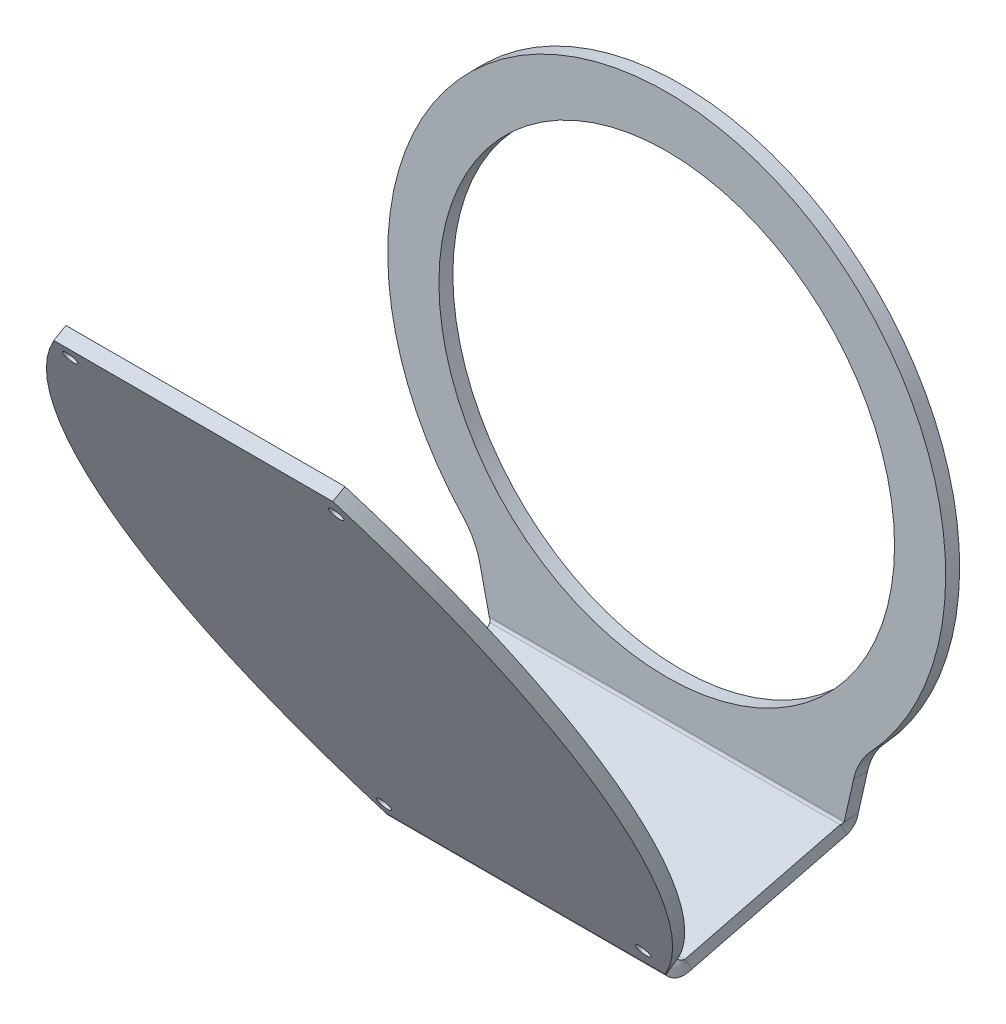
ISO-10303-21;
HEADER;
FILE_DESCRIPTION(('STEP AP214'),'2;1');
FILE_NAME('part.step','',(''),(''),'','','');
FILE_SCHEMA(('AUTOMOTIVE_DESIGN { 1 0 10303 214 1 1 1 1 }'));
ENDSEC;
DATA;
#1=APPLICATION_CONTEXT('core data for automotive mechanical design processes');
#2=APPLICATION_PROTOCOL_DEFINITION('international standard','automotive_design',2000,#1);
#3=PRODUCT_CONTEXT('',#1,'mechanical');
#4=PRODUCT('Part','Part','',(#3));
#5=PRODUCT_RELATED_PRODUCT_CATEGORY('part','',(#4));
#6=PRODUCT_DEFINITION_FORMATION('','',#4);
#7=PRODUCT_DEFINITION_CONTEXT('part definition',#1,'design');
#8=PRODUCT_DEFINITION('design','',#6,#7);
#9=PRODUCT_DEFINITION_SHAPE('','',#8);
#10=(LENGTH_UNIT() NAMED_UNIT(*) SI_UNIT(.MILLI.,.METRE.));
#11=(NAMED_UNIT(*) PLANE_ANGLE_UNIT() SI_UNIT($,.RADIAN.));
#12=(NAMED_UNIT(*) SI_UNIT($,.STERADIAN.) SOLID_ANGLE_UNIT());
#13=UNCERTAINTY_MEASURE_WITH_UNIT(LENGTH_MEASURE(1.E-05),#10,'distance_accuracy_value','');
#14=(GEOMETRIC_REPRESENTATION_CONTEXT(3) GLOBAL_UNCERTAINTY_ASSIGNED_CONTEXT((#13)) GLOBAL_UNIT_ASSIGNED_CONTEXT((#10,
#11,#12)) REPRESENTATION_CONTEXT('',''));
#15=CARTESIAN_POINT('',(0.,0.,0.));
#16=DIRECTION('',(0.,0.,1.));
#17=DIRECTION('',(1.,0.,0.));
#18=AXIS2_PLACEMENT_3D('',#15,#16,#17);
#19=CARTESIAN_POINT('',(44.4210037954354,32.5729930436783,-47.8753593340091));
#20=DIRECTION('',(0.,0.86602540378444,0.499999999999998));
#21=DIRECTION('',(1.,0.,0.));
#22=AXIS2_PLACEMENT_3D('',#19,#20,#21);
#23=PLANE('',#22);
#24=DIRECTION('',(0.22032682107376,0.487713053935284,-0.844743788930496));
#25=VECTOR('',#24,1.);
#26=CARTESIAN_POINT('',(85.5628097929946,10.736373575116,-10.0532249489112));
#27=LINE('',#26,#25);
#28=CARTESIAN_POINT('',(75.1566013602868,-12.2986962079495,29.8446862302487));
#29=VERTEX_POINT('',#28);
#30=CARTESIAN_POINT('',(82.06219580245,2.98745253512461,3.36830000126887));
#31=VERTEX_POINT('',#30);
#32=EDGE_CURVE('E222',#29,#31,#27,.T.);
#33=ORIENTED_EDGE('',*,*,#32,.T.);
#34=DIRECTION('',(-1.,0.,0.));
#35=VECTOR('',#34,1.);
#36=CARTESIAN_POINT('',(44.4210037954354,2.98745253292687,3.3683));
#37=LINE('',#36,#35);
#38=CARTESIAN_POINT('',(6.77981178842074,2.98745253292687,3.3683));
#39=VERTEX_POINT('',#38);
#40=EDGE_CURVE('E195',#31,#39,#37,.T.);
#41=ORIENTED_EDGE('',*,*,#40,.T.);
#42=DIRECTION('',(0.22032682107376,-0.487713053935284,0.844743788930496));
#43=VECTOR('',#42,1.);
#44=CARTESIAN_POINT('',(3.27919779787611,10.736373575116,-10.0532249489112));
#45=LINE('',#44,#43);
#46=CARTESIAN_POINT('',(13.685406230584,-12.2986962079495,29.8446862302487));
#47=VERTEX_POINT('',#46);
#48=EDGE_CURVE('E227',#39,#47,#45,.T.);
#49=ORIENTED_EDGE('',*,*,#48,.T.);
#50=DIRECTION('',(-1.,0.,0.));
#51=VECTOR('',#50,1.);
#52=CARTESIAN_POINT('',(44.4210037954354,-12.2986961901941,29.8446862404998));
#53=LINE('',#52,#51);
#54=EDGE_CURVE('E224',#29,#47,#53,.T.);
#55=ORIENTED_EDGE('',*,*,#54,.F.);
#56=EDGE_LOOP('',(#33,#41,#49,#55));
#57=FACE_BOUND('',#56,.T.);
#58=ADVANCED_FACE('F78',(#57),#23,.T.);
#59=CARTESIAN_POINT('',(44.4210037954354,-92.7916851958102,-15.7774102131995));
#60=DIRECTION('',(0.,0.499999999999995,-0.866025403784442));
#61=DIRECTION('',(1.,0.,0.));
#62=AXIS2_PLACEMENT_3D('',#59,#60,#61);
#63=PLANE('',#62);
#64=CARTESIAN_POINT('',(15.9210037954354,108.12620848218,100.222589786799));
#65=DIRECTION('',(0.,0.499999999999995,-0.866025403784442));
#66=DIRECTION('',(-1.,0.,0.));
#67=AXIS2_PLACEMENT_3D('',#64,#65,#66);
#68=CIRCLE('',#67,1.5);
#69=CARTESIAN_POINT('',(14.4210037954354,108.12620848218,100.222589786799));
#70=VERTEX_POINT('',#69);
#71=EDGE_CURVE('E294',#70,#70,#68,.T.);
#72=ORIENTED_EDGE('',*,*,#71,.F.);
#73=EDGE_LOOP('',(#72));
#74=FACE_BOUND('',#73,.T.);
#75=CARTESIAN_POINT('',(72.4210037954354,-7.4881829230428,33.4725897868));
#76=DIRECTION('',(0.,0.499999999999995,-0.866025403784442));
#77=DIRECTION('',(1.,0.,0.));
#78=AXIS2_PLACEMENT_3D('',#75,#76,#77);
#79=CIRCLE('',#78,1.5);
#80=CARTESIAN_POINT('',(73.9210037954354,-7.4881829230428,33.4725897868));
#81=VERTEX_POINT('',#80);
#82=EDGE_CURVE('E559',#81,#81,#79,.T.);
#83=ORIENTED_EDGE('',*,*,#82,.F.);
#84=EDGE_LOOP('',(#83));
#85=FACE_BOUND('',#84,.T.);
#86=CARTESIAN_POINT('',(72.4210037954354,106.827170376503,99.4725897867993));
#87=DIRECTION('',(0.,0.499999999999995,-0.866025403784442));
#88=DIRECTION('',(-1.,0.,0.));
#89=AXIS2_PLACEMENT_3D('',#86,#87,#88);
#90=CIRCLE('',#89,1.5);
#91=CARTESIAN_POINT('',(70.9210037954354,106.827170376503,99.4725897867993));
#92=VERTEX_POINT('',#91);
#93=EDGE_CURVE('E563',#92,#92,#90,.T.);
#94=ORIENTED_EDGE('',*,*,#93,.F.);
#95=EDGE_LOOP('',(#94));
#96=FACE_BOUND('',#95,.T.);
#97=CARTESIAN_POINT('',(15.9210037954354,-8.78722102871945,32.7225897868));
#98=DIRECTION('',(0.,0.499999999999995,-0.866025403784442));
#99=DIRECTION('',(1.,0.,0.));
#100=AXIS2_PLACEMENT_3D('',#97,#98,#99);
#101=CIRCLE('',#100,1.5);
#102=CARTESIAN_POINT('',(17.4210037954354,-8.78722102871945,32.7225897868));
#103=VERTEX_POINT('',#102);
#104=EDGE_CURVE('E566',#103,#103,#101,.T.);
#105=ORIENTED_EDGE('',*,*,#104,.F.);
#106=EDGE_LOOP('',(#105));
#107=FACE_BOUND('',#106,.T.);
#108=CARTESIAN_POINT('',(-26.5830184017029,49.6694937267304,66.4725897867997));
#109=DIRECTION('',(0.,0.499999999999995,-0.866025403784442));
#110=DIRECTION('',(-1.,0.,0.));
#111=AXIS2_PLACEMENT_3D('',#108,#109,#110);
#112=CIRCLE('',#111,123.75);
#113=CARTESIAN_POINT('',(74.4210037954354,111.590310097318,102.222589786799));
#114=VERTEX_POINT('',#113);
#115=CARTESIAN_POINT('',(74.6021757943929,-12.0290818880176,30.8509005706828));
#116=VERTEX_POINT('',#115);
#117=EDGE_CURVE('E507',#114,#116,#112,.T.);
#118=ORIENTED_EDGE('',*,*,#117,.T.);
#119=DIRECTION('',(-1.,0.,0.));
#120=VECTOR('',#119,1.);
#121=CARTESIAN_POINT('',(44.4210037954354,-12.0290818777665,30.8509005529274));
#122=LINE('',#121,#120);
#123=CARTESIAN_POINT('',(14.2398317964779,-12.0290818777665,30.8509005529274));
#124=VERTEX_POINT('',#123);
#125=EDGE_CURVE('E461',#116,#124,#122,.T.);
#126=ORIENTED_EDGE('',*,*,#125,.T.);
#127=CARTESIAN_POINT('',(115.425025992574,49.6694937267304,66.4725897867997));
#128=DIRECTION('',(0.,0.499999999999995,-0.866025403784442));
#129=DIRECTION('',(1.,0.,0.));
#130=AXIS2_PLACEMENT_3D('',#127,#128,#129);
#131=CIRCLE('',#130,123.75);
#132=CARTESIAN_POINT('',(14.4210037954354,111.590310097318,102.222589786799));
#133=VERTEX_POINT('',#132);
#134=EDGE_CURVE('E481',#124,#133,#131,.T.);
#135=ORIENTED_EDGE('',*,*,#134,.T.);
#136=DIRECTION('',(1.,0.,0.));
#137=VECTOR('',#136,1.);
#138=CARTESIAN_POINT('',(74.4210037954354,111.590310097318,102.222589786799));
#139=LINE('',#138,#137);
#140=EDGE_CURVE('E518',#133,#114,#139,.T.);
#141=ORIENTED_EDGE('',*,*,#140,.T.);
#142=EDGE_LOOP('',(#118,#126,#135,#141));
#143=FACE_BOUND('',#142,.T.);
#144=ADVANCED_FACE('F506',(#74,#85,#96,#107,#143),#63,.T.);
#145=CARTESIAN_POINT('',(44.4210037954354,-94.2916851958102,-13.1793340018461));
#146=DIRECTION('',(0.,0.499999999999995,-0.866025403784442));
#147=DIRECTION('',(1.,0.,0.));
#148=AXIS2_PLACEMENT_3D('',#145,#146,#147);
#149=PLANE('',#148);
#150=DIRECTION('',(-1.,0.,0.));
#151=VECTOR('',#150,1.);
#152=CARTESIAN_POINT('',(44.4210037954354,-13.5290818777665,33.4489767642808));
#153=LINE('',#152,#151);
#154=CARTESIAN_POINT('',(74.6021757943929,-13.5290818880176,33.4489767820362));
#155=VERTEX_POINT('',#154);
#156=CARTESIAN_POINT('',(14.2398317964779,-13.5290818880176,33.4489767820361));
#157=VERTEX_POINT('',#156);
#158=EDGE_CURVE('E460',#155,#157,#153,.T.);
#159=ORIENTED_EDGE('',*,*,#158,.F.);
#160=CARTESIAN_POINT('',(-26.5830184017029,48.1694937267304,69.070665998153));
#161=DIRECTION('',(0.,0.499999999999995,-0.866025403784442));
#162=DIRECTION('',(-1.,0.,0.));
#163=AXIS2_PLACEMENT_3D('',#160,#161,#162);
#164=CIRCLE('',#163,123.75);
#165=CARTESIAN_POINT('',(74.4210037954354,110.090310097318,104.820665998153));
#166=VERTEX_POINT('',#165);
#167=EDGE_CURVE('E475',#166,#155,#164,.T.);
#168=ORIENTED_EDGE('',*,*,#167,.F.);
#169=DIRECTION('',(1.,0.,0.));
#170=VECTOR('',#169,1.);
#171=CARTESIAN_POINT('',(74.4210037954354,110.090310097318,104.820665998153));
#172=LINE('',#171,#170);
#173=CARTESIAN_POINT('',(14.4210037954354,110.090310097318,104.820665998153));
#174=VERTEX_POINT('',#173);
#175=EDGE_CURVE('E482',#174,#166,#172,.T.);
#176=ORIENTED_EDGE('',*,*,#175,.F.);
#177=CARTESIAN_POINT('',(115.425025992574,48.1694937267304,69.070665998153));
#178=DIRECTION('',(0.,0.499999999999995,-0.866025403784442));
#179=DIRECTION('',(1.,0.,0.));
#180=AXIS2_PLACEMENT_3D('',#177,#178,#179);
#181=CIRCLE('',#180,123.75);
#182=EDGE_CURVE('E487',#157,#174,#181,.T.);
#183=ORIENTED_EDGE('',*,*,#182,.F.);
#184=EDGE_LOOP('',(#159,#168,#176,#183));
#185=FACE_BOUND('',#184,.T.);
#186=CARTESIAN_POINT('',(15.9210037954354,106.62620848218,102.820665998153));
#187=DIRECTION('',(0.,0.499999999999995,-0.866025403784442));
#188=DIRECTION('',(1.,0.,0.));
#189=AXIS2_PLACEMENT_3D('',#186,#187,#188);
#190=CIRCLE('',#189,1.5);
#191=CARTESIAN_POINT('',(17.4210037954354,106.62620848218,102.820665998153));
#192=VERTEX_POINT('',#191);
#193=EDGE_CURVE('E513',#192,#192,#190,.T.);
#194=ORIENTED_EDGE('',*,*,#193,.T.);
#195=EDGE_LOOP('',(#194));
#196=FACE_BOUND('',#195,.T.);
#197=CARTESIAN_POINT('',(72.4210037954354,-8.98818292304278,36.0706659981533));
#198=DIRECTION('',(0.,0.499999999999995,-0.866025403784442));
#199=DIRECTION('',(1.,0.,0.));
#200=AXIS2_PLACEMENT_3D('',#197,#198,#199);
#201=CIRCLE('',#200,1.5);
#202=CARTESIAN_POINT('',(73.9210037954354,-8.98818292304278,36.0706659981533));
#203=VERTEX_POINT('',#202);
#204=EDGE_CURVE('E579',#203,#203,#201,.T.);
#205=ORIENTED_EDGE('',*,*,#204,.T.);
#206=EDGE_LOOP('',(#205));
#207=FACE_BOUND('',#206,.T.);
#208=CARTESIAN_POINT('',(72.4210037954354,105.327170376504,102.070665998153));
#209=DIRECTION('',(0.,0.499999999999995,-0.866025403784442));
#210=DIRECTION('',(1.,0.,0.));
#211=AXIS2_PLACEMENT_3D('',#208,#209,#210);
#212=CIRCLE('',#211,1.5);
#213=CARTESIAN_POINT('',(73.9210037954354,105.327170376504,102.070665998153));
#214=VERTEX_POINT('',#213);
#215=EDGE_CURVE('E568',#214,#214,#212,.T.);
#216=ORIENTED_EDGE('',*,*,#215,.T.);
#217=EDGE_LOOP('',(#216));
#218=FACE_BOUND('',#217,.T.);
#219=CARTESIAN_POINT('',(15.9210037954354,-10.2872210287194,35.3206659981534));
#220=DIRECTION('',(0.,0.499999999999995,-0.866025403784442));
#221=DIRECTION('',(1.,0.,0.));
#222=AXIS2_PLACEMENT_3D('',#219,#220,#221);
#223=CIRCLE('',#222,1.5);
#224=CARTESIAN_POINT('',(17.4210037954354,-10.2872210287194,35.3206659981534));
#225=VERTEX_POINT('',#224);
#226=EDGE_CURVE('E496',#225,#225,#223,.T.);
#227=ORIENTED_EDGE('',*,*,#226,.T.);
#228=EDGE_LOOP('',(#227));
#229=FACE_BOUND('',#228,.T.);
#230=ADVANCED_FACE('F485',(#185,#196,#207,#218,#229),#149,.F.);
#231=CARTESIAN_POINT('',(115.425025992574,49.6694937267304,66.4725897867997));
#232=DIRECTION('',(0.,-0.499999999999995,0.866025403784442));
#233=DIRECTION('',(-1.,0.,0.));
#234=AXIS2_PLACEMENT_3D('',#231,#232,#233);
#235=CYLINDRICAL_SURFACE('',#234,123.75);
#236=CARTESIAN_POINT('',(14.2398317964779,-13.5290818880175,33.4489767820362));
#237=CARTESIAN_POINT('',(14.2398317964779,-12.0290818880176,30.8509005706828));
#238=B_SPLINE_CURVE_WITH_KNOTS('',1,(#236,#237),.UNSPECIFIED.,.F.,.F.,(2,2),(0.,1.),.UNSPECIFIED.);
#239=EDGE_CURVE('E205',#157,#124,#238,.T.);
#240=ORIENTED_EDGE('',*,*,#239,.F.);
#241=ORIENTED_EDGE('',*,*,#182,.T.);
#242=DIRECTION('',(0.,-0.499999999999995,0.866025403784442));
#243=VECTOR('',#242,1.);
#244=CARTESIAN_POINT('',(14.4210037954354,111.590310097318,102.222589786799));
#245=LINE('',#244,#243);
#246=EDGE_CURVE('E508',#133,#174,#245,.T.);
#247=ORIENTED_EDGE('',*,*,#246,.F.);
#248=ORIENTED_EDGE('',*,*,#134,.F.);
#249=EDGE_LOOP('',(#240,#241,#247,#248));
#250=FACE_BOUND('',#249,.T.);
#251=ADVANCED_FACE('F500',(#250),#235,.T.);
#252=CARTESIAN_POINT('',(74.4210037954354,111.590310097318,102.222589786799));
#253=DIRECTION('',(0.,-0.866025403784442,-0.499999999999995));
#254=DIRECTION('',(0.,0.499999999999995,-0.866025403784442));
#255=AXIS2_PLACEMENT_3D('',#252,#253,#254);
#256=PLANE('',#255);
#257=ORIENTED_EDGE('',*,*,#175,.T.);
#258=DIRECTION('',(0.,-0.499999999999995,0.866025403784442));
#259=VECTOR('',#258,1.);
#260=CARTESIAN_POINT('',(74.4210037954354,111.590310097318,102.222589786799));
#261=LINE('',#260,#259);
#262=EDGE_CURVE('E478',#114,#166,#261,.T.);
#263=ORIENTED_EDGE('',*,*,#262,.F.);
#264=ORIENTED_EDGE('',*,*,#140,.F.);
#265=ORIENTED_EDGE('',*,*,#246,.T.);
#266=EDGE_LOOP('',(#257,#263,#264,#265));
#267=FACE_BOUND('',#266,.T.);
#268=ADVANCED_FACE('F537',(#267),#256,.F.);
#269=CARTESIAN_POINT('',(-26.5830184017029,49.6694937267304,66.4725897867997));
#270=DIRECTION('',(0.,-0.499999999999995,0.866025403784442));
#271=DIRECTION('',(-1.,0.,0.));
#272=AXIS2_PLACEMENT_3D('',#269,#270,#271);
#273=CYLINDRICAL_SURFACE('',#272,123.75);
#274=CARTESIAN_POINT('',(74.6021757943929,-12.0290818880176,30.8509005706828));
#275=CARTESIAN_POINT('',(74.6021757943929,-13.5290818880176,33.4489767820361));
#276=B_SPLINE_CURVE_WITH_KNOTS('',1,(#274,#275),.UNSPECIFIED.,.F.,.F.,(2,2),(0.,1.),.UNSPECIFIED.);
#277=EDGE_CURVE('E442',#116,#155,#276,.T.);
#278=ORIENTED_EDGE('',*,*,#277,.F.);
#279=ORIENTED_EDGE('',*,*,#117,.F.);
#280=ORIENTED_EDGE('',*,*,#262,.T.);
#281=ORIENTED_EDGE('',*,*,#167,.T.);
#282=EDGE_LOOP('',(#278,#279,#280,#281));
#283=FACE_BOUND('',#282,.T.);
#284=ADVANCED_FACE('F476',(#283),#273,.T.);
#285=CARTESIAN_POINT('',(15.9210037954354,-13.7872210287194,41.3828438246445));
#286=DIRECTION('',(0.,0.499999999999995,-0.866025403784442));
#287=DIRECTION('',(1.,0.,0.));
#288=AXIS2_PLACEMENT_3D('',#285,#286,#287);
#289=CYLINDRICAL_SURFACE('',#288,1.5);
#290=ORIENTED_EDGE('',*,*,#104,.T.);
#291=EDGE_LOOP('',(#290));
#292=FACE_BOUND('',#291,.T.);
#293=ORIENTED_EDGE('',*,*,#226,.F.);
#294=EDGE_LOOP('',(#293));
#295=FACE_BOUND('',#294,.T.);
#296=ADVANCED_FACE('F536',(#292,#295),#289,.F.);
#297=CARTESIAN_POINT('',(72.4210037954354,101.827170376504,108.132843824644));
#298=DIRECTION('',(0.,0.499999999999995,-0.866025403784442));
#299=DIRECTION('',(1.,0.,0.));
#300=AXIS2_PLACEMENT_3D('',#297,#298,#299);
#301=CYLINDRICAL_SURFACE('',#300,1.5);
#302=ORIENTED_EDGE('',*,*,#93,.T.);
#303=EDGE_LOOP('',(#302));
#304=FACE_BOUND('',#303,.T.);
#305=ORIENTED_EDGE('',*,*,#215,.F.);
#306=EDGE_LOOP('',(#305));
#307=FACE_BOUND('',#306,.T.);
#308=ADVANCED_FACE('F604',(#304,#307),#301,.F.);
#309=CARTESIAN_POINT('',(72.4210037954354,-12.4881829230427,42.1328438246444));
#310=DIRECTION('',(0.,0.499999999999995,-0.866025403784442));
#311=DIRECTION('',(1.,0.,0.));
#312=AXIS2_PLACEMENT_3D('',#309,#310,#311);
#313=CYLINDRICAL_SURFACE('',#312,1.5);
#314=ORIENTED_EDGE('',*,*,#82,.T.);
#315=EDGE_LOOP('',(#314));
#316=FACE_BOUND('',#315,.T.);
#317=ORIENTED_EDGE('',*,*,#204,.F.);
#318=EDGE_LOOP('',(#317));
#319=FACE_BOUND('',#318,.T.);
#320=ADVANCED_FACE('F596',(#316,#319),#313,.F.);
#321=CARTESIAN_POINT('',(15.9210037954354,103.12620848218,108.882843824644));
#322=DIRECTION('',(0.,0.499999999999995,-0.866025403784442));
#323=DIRECTION('',(1.,0.,0.));
#324=AXIS2_PLACEMENT_3D('',#321,#322,#323);
#325=CYLINDRICAL_SURFACE('',#324,1.5);
#326=ORIENTED_EDGE('',*,*,#71,.T.);
#327=EDGE_LOOP('',(#326));
#328=FACE_BOUND('',#327,.T.);
#329=ORIENTED_EDGE('',*,*,#193,.F.);
#330=EDGE_LOOP('',(#329));
#331=FACE_BOUND('',#330,.T.);
#332=ADVANCED_FACE('F252',(#328,#331),#325,.F.);
#333=CARTESIAN_POINT('',(85.5628097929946,10.736373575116,-10.0532249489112));
#334=DIRECTION('',(-0.975426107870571,0.11016341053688,-0.190808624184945));
#335=DIRECTION('',(-0.22032682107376,-0.487713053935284,0.844743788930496));
#336=AXIS2_PLACEMENT_3D('',#333,#334,#335);
#337=PLANE('',#336);
#338=CARTESIAN_POINT('',(82.06219580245,2.98745253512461,3.36830000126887));
#339=CARTESIAN_POINT('',(82.06219580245,0.389376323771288,1.86830000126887));
#340=B_SPLINE_CURVE_WITH_KNOTS('',1,(#338,#339),.UNSPECIFIED.,.F.,.F.,(2,2),(0.,1.),.UNSPECIFIED.);
#341=CARTESIAN_POINT('',(82.06219580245,0.389376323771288,1.86830000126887));
#342=VERTEX_POINT('',#341);
#343=EDGE_CURVE('E204',#31,#342,#340,.T.);
#344=ORIENTED_EDGE('',*,*,#343,.F.);
#345=ORIENTED_EDGE('',*,*,#32,.F.);
#346=CARTESIAN_POINT('',(75.1566013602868,-14.8967724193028,28.3446862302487));
#347=CARTESIAN_POINT('',(75.1566013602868,-12.2986962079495,29.8446862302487));
#348=B_SPLINE_CURVE_WITH_KNOTS('',1,(#346,#347),.UNSPECIFIED.,.F.,.F.,(2,2),(0.,1.),.UNSPECIFIED.);
#349=CARTESIAN_POINT('',(75.1566013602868,-14.8967724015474,28.3446862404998));
#350=VERTEX_POINT('',#349);
#351=EDGE_CURVE('E282',#29,#350,#348,.F.);
#352=ORIENTED_EDGE('',*,*,#351,.T.);
#353=DIRECTION('',(0.22032682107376,0.487713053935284,-0.844743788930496));
#354=VECTOR('',#353,1.);
#355=CARTESIAN_POINT('',(85.5628097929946,8.13829736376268,-11.5532249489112));
#356=LINE('',#355,#354);
#357=EDGE_CURVE('E233',#350,#342,#356,.T.);
#358=ORIENTED_EDGE('',*,*,#357,.T.);
#359=EDGE_LOOP('',(#344,#345,#352,#358));
#360=FACE_BOUND('',#359,.T.);
#361=ADVANCED_FACE('F231',(#360),#337,.F.);
#362=CARTESIAN_POINT('',(44.4210037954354,29.974916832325,-49.3753593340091));
#363=DIRECTION('',(0.,0.86602540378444,0.499999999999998));
#364=DIRECTION('',(1.,0.,0.));
#365=AXIS2_PLACEMENT_3D('',#362,#363,#364);
#366=PLANE('',#365);
#367=DIRECTION('',(-1.,0.,0.));
#368=VECTOR('',#367,1.);
#369=CARTESIAN_POINT('',(44.4210037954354,0.389376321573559,1.86829999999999));
#370=LINE('',#369,#368);
#371=CARTESIAN_POINT('',(6.77981178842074,0.389376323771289,1.86830000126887));
#372=VERTEX_POINT('',#371);
#373=EDGE_CURVE('E89',#342,#372,#370,.T.);
#374=ORIENTED_EDGE('',*,*,#373,.F.);
#375=ORIENTED_EDGE('',*,*,#357,.F.);
#376=DIRECTION('',(-1.,0.,0.));
#377=VECTOR('',#376,1.);
#378=CARTESIAN_POINT('',(44.4210037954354,-14.8967724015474,28.3446862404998));
#379=LINE('',#378,#377);
#380=CARTESIAN_POINT('',(13.685406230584,-14.8967724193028,28.3446862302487));
#381=VERTEX_POINT('',#380);
#382=EDGE_CURVE('E288',#350,#381,#379,.T.);
#383=ORIENTED_EDGE('',*,*,#382,.T.);
#384=DIRECTION('',(0.22032682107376,-0.487713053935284,0.844743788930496));
#385=VECTOR('',#384,1.);
#386=CARTESIAN_POINT('',(3.27919779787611,8.13829736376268,-11.5532249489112));
#387=LINE('',#386,#385);
#388=EDGE_CURVE('E286',#372,#381,#387,.T.);
#389=ORIENTED_EDGE('',*,*,#388,.F.);
#390=EDGE_LOOP('',(#374,#375,#383,#389));
#391=FACE_BOUND('',#390,.T.);
#392=ADVANCED_FACE('F251',(#391),#366,.F.);
#393=CARTESIAN_POINT('',(3.27919779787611,10.736373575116,-10.0532249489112));
#394=DIRECTION('',(0.975426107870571,0.11016341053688,-0.190808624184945));
#395=DIRECTION('',(-0.22032682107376,0.487713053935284,-0.844743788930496));
#396=AXIS2_PLACEMENT_3D('',#393,#394,#395);
#397=PLANE('',#396);
#398=CARTESIAN_POINT('',(6.77981178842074,0.389376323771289,1.86830000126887));
#399=CARTESIAN_POINT('',(6.77981178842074,2.98745253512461,3.36830000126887));
#400=B_SPLINE_CURVE_WITH_KNOTS('',1,(#398,#399),.UNSPECIFIED.,.F.,.F.,(2,2),(0.,1.),.UNSPECIFIED.);
#401=EDGE_CURVE('E12',#372,#39,#400,.T.);
#402=ORIENTED_EDGE('',*,*,#401,.F.);
#403=ORIENTED_EDGE('',*,*,#388,.T.);
#404=CARTESIAN_POINT('',(13.685406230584,-12.2986962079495,29.8446862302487));
#405=CARTESIAN_POINT('',(13.685406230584,-14.8967724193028,28.3446862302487));
#406=B_SPLINE_CURVE_WITH_KNOTS('',1,(#404,#405),.UNSPECIFIED.,.F.,.F.,(2,2),(0.,1.),.UNSPECIFIED.);
#407=EDGE_CURVE('E287',#381,#47,#406,.F.);
#408=ORIENTED_EDGE('',*,*,#407,.T.);
#409=ORIENTED_EDGE('',*,*,#48,.F.);
#410=EDGE_LOOP('',(#402,#403,#408,#409));
#411=FACE_BOUND('',#410,.T.);
#412=ADVANCED_FACE('F80',(#411),#397,.F.);
#413=CARTESIAN_POINT('',(74.6021757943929,-13.5290818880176,33.4489767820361));
#414=CARTESIAN_POINT('',(74.5417848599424,-13.6528454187,33.3775218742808));
#415=CARTESIAN_POINT('',(74.4813947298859,-13.7725032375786,33.2989602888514));
#416=CARTESIAN_POINT('',(74.4210037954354,-13.8872724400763,33.2138060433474));
#417=CARTESIAN_POINT('',(74.6021757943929,-12.0290818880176,30.8509005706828));
#418=CARTESIAN_POINT('',(74.5417850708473,-12.0534794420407,30.8368146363));
#419=CARTESIAN_POINT('',(74.481394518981,-12.077067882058,30.8213275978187));
#420=CARTESIAN_POINT('',(74.4210037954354,-12.099692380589,30.8045411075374));
#421=B_SPLINE_SURFACE_WITH_KNOTS('',1,3,((#413,#414,#415,#416),(#417,#418,#419,#420)),
.UNSPECIFIED.,.F.,.F.,.F.,(2,2),(4,4),(0.,1.),(0.,1.),.UNSPECIFIED.);
#422=CARTESIAN_POINT('',(74.6021757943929,-13.5290818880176,33.4489767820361));
#423=CARTESIAN_POINT('',(74.5417848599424,-13.6528454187,33.3775218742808));
#424=CARTESIAN_POINT('',(74.4813947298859,-13.7725032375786,33.2989602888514));
#425=CARTESIAN_POINT('',(74.4210037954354,-13.8872724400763,33.2138060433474));
#426=B_SPLINE_CURVE_WITH_KNOTS('',3,(#422,#423,#424,#425),.UNSPECIFIED.,.F.,.F.,(4,4),(0.,1.),.UNSPECIFIED.);
#427=CARTESIAN_POINT('',(74.4210041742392,-13.8872717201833,33.2138065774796));
#428=VERTEX_POINT('',#427);
#429=EDGE_CURVE('E451',#155,#428,#426,.T.);
#430=CARTESIAN_POINT('',(74.4210037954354,-13.8872724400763,33.2138060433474));
#431=CARTESIAN_POINT('',(74.4210037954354,-12.099692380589,30.8045411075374));
#432=B_SPLINE_CURVE_WITH_KNOTS('',1,(#430,#431),.UNSPECIFIED.,.F.,.F.,(2,2),(0.,1.),.UNSPECIFIED.);
#433=CARTESIAN_POINT('',(74.4210037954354,-12.099692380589,30.8045411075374));
#434=VERTEX_POINT('',#433);
#435=EDGE_CURVE('E267',#428,#434,#432,.T.);
#436=CARTESIAN_POINT('',(74.4210037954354,-12.099692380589,30.8045411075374));
#437=CARTESIAN_POINT('',(74.481394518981,-12.077067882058,30.8213275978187));
#438=CARTESIAN_POINT('',(74.5417850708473,-12.0534794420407,30.8368146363));
#439=CARTESIAN_POINT('',(74.6021757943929,-12.0290818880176,30.8509005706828));
#440=B_SPLINE_CURVE_WITH_KNOTS('',3,(#436,#437,#438,#439),.UNSPECIFIED.,.F.,.F.,(4,4),(0.,1.),.UNSPECIFIED.);
#441=EDGE_CURVE('E453',#116,#434,#440,.F.);
#442=ORIENTED_EDGE('',*,*,#277,.T.);
#443=ORIENTED_EDGE('',*,*,#429,.T.);
#444=ORIENTED_EDGE('',*,*,#435,.T.);
#445=ORIENTED_EDGE('',*,*,#441,.F.);
#446=EDGE_LOOP('',(#442,#443,#444,#445));
#447=FACE_BOUND('',#446,.T.);
#448=ADVANCED_FACE('F323',(#447),#421,.F.);
#449=CARTESIAN_POINT('',(74.4210037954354,-13.8872724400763,33.2138060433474));
#450=CARTESIAN_POINT('',(74.4823116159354,-14.2514343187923,32.9436122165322));
#451=CARTESIAN_POINT('',(74.5436033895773,-14.5656883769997,32.6065740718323));
#452=CARTESIAN_POINT('',(74.6662029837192,-15.0538312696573,31.8423911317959));
#453=CARTESIAN_POINT('',(74.7275027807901,-15.2275304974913,31.4155039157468));
#454=CARTESIAN_POINT('',(74.850102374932,-15.4116167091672,30.5276011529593));
#455=CARTESIAN_POINT('',(74.911402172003,-15.4219501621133,30.0668438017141));
#456=CARTESIAN_POINT('',(75.0340017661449,-15.2778551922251,29.1715808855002));
#457=CARTESIAN_POINT('',(75.0952935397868,-15.1234983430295,28.7373870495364));
#458=CARTESIAN_POINT('',(75.1566013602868,-14.8967724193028,28.3446862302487));
#459=CARTESIAN_POINT('',(74.4210037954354,-12.099692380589,30.8045411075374));
#460=CARTESIAN_POINT('',(74.4823091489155,-12.171477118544,30.7512796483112));
#461=CARTESIAN_POINT('',(74.5436033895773,-12.2334292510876,30.6848368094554));
#462=CARTESIAN_POINT('',(74.6662029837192,-12.3296573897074,30.5341925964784));
#463=CARTESIAN_POINT('',(74.7275027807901,-12.3638989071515,30.4500398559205));
#464=CARTESIAN_POINT('',(74.850102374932,-12.400188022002,30.2750066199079));
#465=CARTESIAN_POINT('',(74.911402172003,-12.4022250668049,30.1841770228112));
#466=CARTESIAN_POINT('',(75.0340017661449,-12.3738194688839,30.0076928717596));
#467=CARTESIAN_POINT('',(75.0952960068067,-12.3433891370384,29.9220966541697));
#468=CARTESIAN_POINT('',(75.1566013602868,-12.2986962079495,29.8446862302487));
#469=B_SPLINE_SURFACE_WITH_KNOTS('',1,3,((#449,#450,#451,#452,#453,#454,#455,#456,#457,#458),
(#459,#460,#461,#462,#463,#464,#465,#466,#467,#468)),.UNSPECIFIED.,.F.,.F.,.F.,(2,2),(4,2,2,2,
4),(0.,1.),(0.,0.25,0.5,0.75,1.),.UNSPECIFIED.);
#470=CARTESIAN_POINT('',(74.4210037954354,-13.8872724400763,33.2138060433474));
#471=CARTESIAN_POINT('',(74.4823116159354,-14.2514343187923,32.9436122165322));
#472=CARTESIAN_POINT('',(74.5436033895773,-14.5656883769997,32.6065740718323));
#473=CARTESIAN_POINT('',(74.6662029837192,-15.0538312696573,31.8423911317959));
#474=CARTESIAN_POINT('',(74.7275027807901,-15.2275304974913,31.4155039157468));
#475=CARTESIAN_POINT('',(74.850102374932,-15.4116167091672,30.5276011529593));
#476=CARTESIAN_POINT('',(74.911402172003,-15.4219501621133,30.0668438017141));
#477=CARTESIAN_POINT('',(75.0340017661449,-15.2778551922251,29.1715808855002));
#478=CARTESIAN_POINT('',(75.0952935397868,-15.1234983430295,28.7373870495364));
#479=CARTESIAN_POINT('',(75.1566013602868,-14.8967724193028,28.3446862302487));
#480=B_SPLINE_CURVE_WITH_KNOTS('',3,(#470,#471,#472,#473,#474,#475,#476,#477,#478,#479),
.UNSPECIFIED.,.F.,.F.,(4,2,2,2,4),(0.,0.25,0.5,0.75,1.),.UNSPECIFIED.);
#481=EDGE_CURVE('E468',#428,#350,#480,.T.);
#482=CARTESIAN_POINT('',(75.1566013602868,-12.2986962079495,29.8446862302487));
#483=CARTESIAN_POINT('',(75.0952960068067,-12.3433891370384,29.9220966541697));
#484=CARTESIAN_POINT('',(75.0340017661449,-12.3738194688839,30.0076928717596));
#485=CARTESIAN_POINT('',(74.911402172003,-12.4022250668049,30.1841770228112));
#486=CARTESIAN_POINT('',(74.850102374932,-12.400188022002,30.2750066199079));
#487=CARTESIAN_POINT('',(74.7275027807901,-12.3638989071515,30.4500398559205));
#488=CARTESIAN_POINT('',(74.6662029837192,-12.3296573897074,30.5341925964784));
#489=CARTESIAN_POINT('',(74.5436033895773,-12.2334292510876,30.6848368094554));
#490=CARTESIAN_POINT('',(74.4823091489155,-12.171477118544,30.7512796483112));
#491=CARTESIAN_POINT('',(74.4210037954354,-12.099692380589,30.8045411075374));
#492=B_SPLINE_CURVE_WITH_KNOTS('',3,(#482,#483,#484,#485,#486,#487,#488,#489,#490,#491),
.UNSPECIFIED.,.F.,.F.,(4,2,2,2,4),(0.,0.25,0.5,0.75,1.),.UNSPECIFIED.);
#493=EDGE_CURVE('E1082',#434,#29,#492,.F.);
#494=ORIENTED_EDGE('',*,*,#435,.F.);
#495=ORIENTED_EDGE('',*,*,#481,.T.);
#496=ORIENTED_EDGE('',*,*,#351,.F.);
#497=ORIENTED_EDGE('',*,*,#493,.F.);
#498=EDGE_LOOP('',(#494,#495,#496,#497));
#499=FACE_BOUND('',#498,.T.);
#500=ADVANCED_FACE('F374',(#499),#469,.F.);
#501=CARTESIAN_POINT('',(13.685406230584,-14.8967724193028,28.3446862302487));
#502=CARTESIAN_POINT('',(13.746714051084,-15.1234983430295,28.7373870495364));
#503=CARTESIAN_POINT('',(13.8080058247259,-15.2778551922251,29.1715808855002));
#504=CARTESIAN_POINT('',(13.9306054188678,-15.4219501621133,30.0668438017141));
#505=CARTESIAN_POINT('',(13.9919052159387,-15.4116167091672,30.5276011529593));
#506=CARTESIAN_POINT('',(14.1145048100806,-15.2275304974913,31.4155039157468));
#507=CARTESIAN_POINT('',(14.1758046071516,-15.0538312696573,31.8423911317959));
#508=CARTESIAN_POINT('',(14.2984042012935,-14.5656883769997,32.6065740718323));
#509=CARTESIAN_POINT('',(14.3596959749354,-14.2514343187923,32.9436122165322));
#510=CARTESIAN_POINT('',(14.4210037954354,-13.8872724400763,33.2138060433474));
#511=CARTESIAN_POINT('',(13.685406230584,-12.2986962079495,29.8446862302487));
#512=CARTESIAN_POINT('',(13.7467115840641,-12.3433891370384,29.9220966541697));
#513=CARTESIAN_POINT('',(13.8080058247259,-12.3738194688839,30.0076928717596));
#514=CARTESIAN_POINT('',(13.9306054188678,-12.4022250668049,30.1841770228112));
#515=CARTESIAN_POINT('',(13.9919052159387,-12.400188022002,30.2750066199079));
#516=CARTESIAN_POINT('',(14.1145048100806,-12.3638989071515,30.4500398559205));
#517=CARTESIAN_POINT('',(14.1758046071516,-12.3296573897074,30.5341925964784));
#518=CARTESIAN_POINT('',(14.2984042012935,-12.2334292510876,30.6848368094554));
#519=CARTESIAN_POINT('',(14.3596984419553,-12.171477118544,30.7512796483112));
#520=CARTESIAN_POINT('',(14.4210037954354,-12.099692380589,30.8045411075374));
#521=B_SPLINE_SURFACE_WITH_KNOTS('',1,3,((#501,#502,#503,#504,#505,#506,#507,#508,#509,#510),
(#511,#512,#513,#514,#515,#516,#517,#518,#519,#520)),.UNSPECIFIED.,.F.,.F.,.F.,(2,2),(4,2,2,2,
4),(0.,1.),(0.,0.25,0.5,0.75,1.),.UNSPECIFIED.);
#522=CARTESIAN_POINT('',(13.685406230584,-14.8967724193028,28.3446862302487));
#523=CARTESIAN_POINT('',(13.746714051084,-15.1234983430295,28.7373870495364));
#524=CARTESIAN_POINT('',(13.8080058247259,-15.2778551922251,29.1715808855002));
#525=CARTESIAN_POINT('',(13.9306054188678,-15.4219501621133,30.0668438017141));
#526=CARTESIAN_POINT('',(13.9919052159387,-15.4116167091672,30.5276011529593));
#527=CARTESIAN_POINT('',(14.1145048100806,-15.2275304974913,31.4155039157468));
#528=CARTESIAN_POINT('',(14.1758046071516,-15.0538312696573,31.8423911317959));
#529=CARTESIAN_POINT('',(14.2984042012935,-14.5656883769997,32.6065740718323));
#530=CARTESIAN_POINT('',(14.3596959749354,-14.2514343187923,32.9436122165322));
#531=CARTESIAN_POINT('',(14.4210037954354,-13.8872724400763,33.2138060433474));
#532=B_SPLINE_CURVE_WITH_KNOTS('',3,(#522,#523,#524,#525,#526,#527,#528,#529,#530,#531),
.UNSPECIFIED.,.F.,.F.,(4,2,2,2,4),(0.,0.25,0.5,0.75,1.),.UNSPECIFIED.);
#533=CARTESIAN_POINT('',(14.421003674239,-13.88727315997,33.2138055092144));
#534=VERTEX_POINT('',#533);
#535=EDGE_CURVE('E1080',#381,#534,#532,.T.);
#536=CARTESIAN_POINT('',(14.4210037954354,-13.8872724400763,33.2138060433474));
#537=CARTESIAN_POINT('',(14.4210037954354,-12.099692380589,30.8045411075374));
#538=B_SPLINE_CURVE_WITH_KNOTS('',1,(#536,#537),.UNSPECIFIED.,.F.,.F.,(2,2),(0.,1.),.UNSPECIFIED.);
#539=CARTESIAN_POINT('',(14.4210037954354,-12.099692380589,30.8045411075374));
#540=VERTEX_POINT('',#539);
#541=EDGE_CURVE('E360',#534,#540,#538,.T.);
#542=CARTESIAN_POINT('',(14.4210037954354,-12.099692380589,30.8045411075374));
#543=CARTESIAN_POINT('',(14.3596984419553,-12.171477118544,30.7512796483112));
#544=CARTESIAN_POINT('',(14.2984042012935,-12.2334292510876,30.6848368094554));
#545=CARTESIAN_POINT('',(14.1758046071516,-12.3296573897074,30.5341925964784));
#546=CARTESIAN_POINT('',(14.1145048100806,-12.3638989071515,30.4500398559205));
#547=CARTESIAN_POINT('',(13.9919052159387,-12.400188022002,30.2750066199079));
#548=CARTESIAN_POINT('',(13.9306054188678,-12.4022250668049,30.1841770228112));
#549=CARTESIAN_POINT('',(13.8080058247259,-12.3738194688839,30.0076928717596));
#550=CARTESIAN_POINT('',(13.7467115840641,-12.3433891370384,29.9220966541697));
#551=CARTESIAN_POINT('',(13.685406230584,-12.2986962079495,29.8446862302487));
#552=B_SPLINE_CURVE_WITH_KNOTS('',3,(#542,#543,#544,#545,#546,#547,#548,#549,#550,#551),
.UNSPECIFIED.,.F.,.F.,(4,2,2,2,4),(0.,0.25,0.5,0.75,1.),.UNSPECIFIED.);
#553=EDGE_CURVE('E1058',#47,#540,#552,.F.);
#554=ORIENTED_EDGE('',*,*,#407,.F.);
#555=ORIENTED_EDGE('',*,*,#535,.T.);
#556=ORIENTED_EDGE('',*,*,#541,.T.);
#557=ORIENTED_EDGE('',*,*,#553,.F.);
#558=EDGE_LOOP('',(#554,#555,#556,#557));
#559=FACE_BOUND('',#558,.T.);
#560=ADVANCED_FACE('F320',(#559),#521,.F.);
#561=CARTESIAN_POINT('',(14.4210037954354,-13.8872724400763,33.2138060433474));
#562=CARTESIAN_POINT('',(14.3606128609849,-13.7725032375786,33.2989602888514));
#563=CARTESIAN_POINT('',(14.3002227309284,-13.6528454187,33.3775218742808));
#564=CARTESIAN_POINT('',(14.2398317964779,-13.5290818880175,33.4489767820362));
#565=CARTESIAN_POINT('',(14.4210037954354,-12.099692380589,30.8045411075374));
#566=CARTESIAN_POINT('',(14.3606130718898,-12.077067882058,30.8213275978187));
#567=CARTESIAN_POINT('',(14.3002225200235,-12.0534794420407,30.8368146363));
#568=CARTESIAN_POINT('',(14.2398317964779,-12.0290818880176,30.8509005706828));
#569=B_SPLINE_SURFACE_WITH_KNOTS('',1,3,((#561,#562,#563,#564),(#565,#566,#567,#568)),
.UNSPECIFIED.,.F.,.F.,.F.,(2,2),(4,4),(0.,1.),(0.,1.),.UNSPECIFIED.);
#570=CARTESIAN_POINT('',(14.4210037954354,-13.8872724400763,33.2138060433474));
#571=CARTESIAN_POINT('',(14.3606128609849,-13.7725032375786,33.2989602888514));
#572=CARTESIAN_POINT('',(14.3002227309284,-13.6528454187,33.3775218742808));
#573=CARTESIAN_POINT('',(14.2398317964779,-13.5290818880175,33.4489767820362));
#574=B_SPLINE_CURVE_WITH_KNOTS('',3,(#570,#571,#572,#573),.UNSPECIFIED.,.F.,.F.,(4,4),(0.,1.),.UNSPECIFIED.);
#575=EDGE_CURVE('E504',#534,#157,#574,.T.);
#576=CARTESIAN_POINT('',(14.2398317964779,-12.0290818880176,30.8509005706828));
#577=CARTESIAN_POINT('',(14.3002225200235,-12.0534794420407,30.8368146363));
#578=CARTESIAN_POINT('',(14.3606130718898,-12.077067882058,30.8213275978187));
#579=CARTESIAN_POINT('',(14.4210037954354,-12.099692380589,30.8045411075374));
#580=B_SPLINE_CURVE_WITH_KNOTS('',3,(#576,#577,#578,#579),.UNSPECIFIED.,.F.,.F.,(4,4),(0.,1.),.UNSPECIFIED.);
#581=EDGE_CURVE('E104',#540,#124,#580,.F.);
#582=ORIENTED_EDGE('',*,*,#575,.T.);
#583=ORIENTED_EDGE('',*,*,#239,.T.);
#584=ORIENTED_EDGE('',*,*,#581,.F.);
#585=ORIENTED_EDGE('',*,*,#541,.F.);
#586=EDGE_LOOP('',(#582,#583,#584,#585));
#587=FACE_BOUND('',#586,.T.);
#588=ADVANCED_FACE('F307',(#587),#569,.F.);
#589=CARTESIAN_POINT('',(-17.2235475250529,-11.6607818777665,30.2129862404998));
#590=DIRECTION('',(1.,0.,0.));
#591=DIRECTION('',(0.,0.499999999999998,-0.86602540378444));
#592=AXIS2_PLACEMENT_3D('',#589,#590,#591);
#593=CYLINDRICAL_SURFACE('',#592,0.736600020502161);
#594=ORIENTED_EDGE('',*,*,#553,.T.);
#595=ORIENTED_EDGE('',*,*,#581,.T.);
#596=ORIENTED_EDGE('',*,*,#125,.F.);
#597=ORIENTED_EDGE('',*,*,#441,.T.);
#598=ORIENTED_EDGE('',*,*,#493,.T.);
#599=ORIENTED_EDGE('',*,*,#54,.T.);
#600=EDGE_LOOP('',(#594,#595,#596,#597,#598,#599));
#601=FACE_BOUND('',#600,.T.);
#602=ADVANCED_FACE('F319',(#601),#593,.F.);
#603=CARTESIAN_POINT('',(-17.2235475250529,-11.6607818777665,30.2129862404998));
#604=DIRECTION('',(1.,0.,0.));
#605=DIRECTION('',(0.,0.499999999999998,-0.86602540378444));
#606=AXIS2_PLACEMENT_3D('',#603,#604,#605);
#607=CYLINDRICAL_SURFACE('',#606,3.73660002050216);
#608=ORIENTED_EDGE('',*,*,#535,.F.);
#609=ORIENTED_EDGE('',*,*,#382,.F.);
#610=ORIENTED_EDGE('',*,*,#481,.F.);
#611=ORIENTED_EDGE('',*,*,#429,.F.);
#612=ORIENTED_EDGE('',*,*,#158,.T.);
#613=ORIENTED_EDGE('',*,*,#575,.F.);
#614=EDGE_LOOP('',(#608,#609,#610,#611,#612,#613));
#615=FACE_BOUND('',#614,.T.);
#616=ADVANCED_FACE('F322',(#615),#607,.T.);
#617=CARTESIAN_POINT('',(44.4210037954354,60.4542858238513,3.));
#618=DIRECTION('',(0.,0.,-1.));
#619=DIRECTION('',(-1.,0.,0.));
#620=AXIS2_PLACEMENT_3D('',#617,#618,#619);
#621=CYLINDRICAL_SURFACE('',#620,49.);
#622=CARTESIAN_POINT('',(44.4210037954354,60.4542858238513,3.));
#623=DIRECTION('',(0.,0.,1.));
#624=DIRECTION('',(1.,0.,0.));
#625=AXIS2_PLACEMENT_3D('',#622,#623,#624);
#626=CIRCLE('',#625,49.);
#627=CARTESIAN_POINT('',(93.4210037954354,60.4542858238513,3.));
#628=VERTEX_POINT('',#627);
#629=EDGE_CURVE('E1017',#628,#628,#626,.T.);
#630=ORIENTED_EDGE('',*,*,#629,.T.);
#631=EDGE_LOOP('',(#630));
#632=FACE_BOUND('',#631,.T.);
#633=CARTESIAN_POINT('',(44.4210037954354,60.4542858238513,0.));
#634=DIRECTION('',(0.,0.,1.));
#635=DIRECTION('',(1.,0.,0.));
#636=AXIS2_PLACEMENT_3D('',#633,#634,#635);
#637=CIRCLE('',#636,49.);
#638=CARTESIAN_POINT('',(93.4210037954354,60.4542858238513,0.));
#639=VERTEX_POINT('',#638);
#640=EDGE_CURVE('E984',#639,#639,#637,.T.);
#641=ORIENTED_EDGE('',*,*,#640,.F.);
#642=EDGE_LOOP('',(#641));
#643=FACE_BOUND('',#642,.T.);
#644=ADVANCED_FACE('F664',(#632,#643),#621,.F.);
#645=CARTESIAN_POINT('',(-10.4033023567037,9.27523293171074,3.));
#646=DIRECTION('',(0.,0.,-1.));
#647=DIRECTION('',(-1.,0.,0.));
#648=AXIS2_PLACEMENT_3D('',#645,#646,#647);
#649=CYLINDRICAL_SURFACE('',#648,15.);
#650=CARTESIAN_POINT('',(-10.4033023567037,9.27523293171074,3.));
#651=DIRECTION('',(0.,0.,1.));
#652=DIRECTION('',(1.,0.,0.));
#653=AXIS2_PLACEMENT_3D('',#650,#651,#652);
#654=CIRCLE('',#653,15.);
#655=CARTESIAN_POINT('',(0.56155887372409,19.5110435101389,3.));
#656=VERTEX_POINT('',#655);
#657=CARTESIAN_POINT('',(4.22808926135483,12.5801352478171,3.));
#658=VERTEX_POINT('',#657);
#659=EDGE_CURVE('E996',#656,#658,#654,.F.);
#660=ORIENTED_EDGE('',*,*,#659,.F.);
#661=DIRECTION('',(0.,0.,-1.));
#662=VECTOR('',#661,1.);
#663=CARTESIAN_POINT('',(0.561558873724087,19.5110435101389,3.));
#664=LINE('',#663,#662);
#665=CARTESIAN_POINT('',(0.56155887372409,19.5110435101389,0.));
#666=VERTEX_POINT('',#665);
#667=EDGE_CURVE('E1012',#666,#656,#664,.F.);
#668=ORIENTED_EDGE('',*,*,#667,.F.);
#669=CARTESIAN_POINT('',(-10.4033023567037,9.27523293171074,0.));
#670=DIRECTION('',(0.,0.,1.));
#671=DIRECTION('',(1.,0.,0.));
#672=AXIS2_PLACEMENT_3D('',#669,#670,#671);
#673=CIRCLE('',#672,15.);
#674=CARTESIAN_POINT('',(4.22808926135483,12.5801352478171,0.));
#675=VERTEX_POINT('',#674);
#676=EDGE_CURVE('E981',#675,#666,#673,.T.);
#677=ORIENTED_EDGE('',*,*,#676,.F.);
#678=DIRECTION('',(0.,0.,1.));
#679=VECTOR('',#678,1.);
#680=CARTESIAN_POINT('',(4.22808926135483,12.5801352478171,0.));
#681=LINE('',#680,#679);
#682=EDGE_CURVE('E470',#658,#675,#681,.F.);
#683=ORIENTED_EDGE('',*,*,#682,.F.);
#684=EDGE_LOOP('',(#660,#668,#677,#683));
#685=FACE_BOUND('',#684,.T.);
#686=ADVANCED_FACE('F670',(#685),#649,.F.);
#687=CARTESIAN_POINT('',(44.4210037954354,60.4542858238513,3.));
#688=DIRECTION('',(0.,0.,-1.));
#689=DIRECTION('',(-1.,0.,0.));
#690=AXIS2_PLACEMENT_3D('',#687,#688,#689);
#691=CYLINDRICAL_SURFACE('',#690,60.);
#692=CARTESIAN_POINT('',(44.4210037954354,60.4542858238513,0.));
#693=DIRECTION('',(0.,0.,1.));
#694=DIRECTION('',(1.,0.,0.));
#695=AXIS2_PLACEMENT_3D('',#692,#693,#694);
#696=CIRCLE('',#695,60.);
#697=CARTESIAN_POINT('',(88.2804487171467,19.5110435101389,0.));
#698=VERTEX_POINT('',#697);
#699=EDGE_CURVE('E1014',#698,#666,#696,.T.);
#700=ORIENTED_EDGE('',*,*,#699,.T.);
#701=ORIENTED_EDGE('',*,*,#667,.T.);
#702=CARTESIAN_POINT('',(44.4210037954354,60.4542858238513,3.));
#703=DIRECTION('',(0.,0.,1.));
#704=DIRECTION('',(1.,0.,0.));
#705=AXIS2_PLACEMENT_3D('',#702,#703,#704);
#706=CIRCLE('',#705,60.);
#707=CARTESIAN_POINT('',(88.2804487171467,19.5110435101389,3.));
#708=VERTEX_POINT('',#707);
#709=EDGE_CURVE('E1000',#708,#656,#706,.T.);
#710=ORIENTED_EDGE('',*,*,#709,.F.);
#711=DIRECTION('',(0.,0.,-1.));
#712=VECTOR('',#711,1.);
#713=CARTESIAN_POINT('',(88.2804487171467,19.5110435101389,3.));
#714=LINE('',#713,#712);
#715=EDGE_CURVE('E1007',#708,#698,#714,.T.);
#716=ORIENTED_EDGE('',*,*,#715,.T.);
#717=EDGE_LOOP('',(#700,#701,#710,#716));
#718=FACE_BOUND('',#717,.T.);
#719=ADVANCED_FACE('F678',(#718),#691,.T.);
#720=CARTESIAN_POINT('',(99.2453099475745,9.27523293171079,3.));
#721=DIRECTION('',(0.,0.,-1.));
#722=DIRECTION('',(-1.,0.,0.));
#723=AXIS2_PLACEMENT_3D('',#720,#721,#722);
#724=CYLINDRICAL_SURFACE('',#723,15.);
#725=CARTESIAN_POINT('',(99.2453099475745,9.27523293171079,3.));
#726=DIRECTION('',(0.,0.,1.));
#727=DIRECTION('',(1.,0.,0.));
#728=AXIS2_PLACEMENT_3D('',#725,#726,#727);
#729=CIRCLE('',#728,15.);
#730=CARTESIAN_POINT('',(84.6139183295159,12.5801352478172,3.));
#731=VERTEX_POINT('',#730);
#732=EDGE_CURVE('E1003',#731,#708,#729,.F.);
#733=ORIENTED_EDGE('',*,*,#732,.F.);
#734=DIRECTION('',(0.,0.,1.));
#735=VECTOR('',#734,1.);
#736=CARTESIAN_POINT('',(84.6139183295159,12.5801352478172,3.));
#737=LINE('',#736,#735);
#738=CARTESIAN_POINT('',(84.6139183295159,12.5801352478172,0.));
#739=VERTEX_POINT('',#738);
#740=EDGE_CURVE('E987',#739,#731,#737,.T.);
#741=ORIENTED_EDGE('',*,*,#740,.F.);
#742=CARTESIAN_POINT('',(99.2453099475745,9.27523293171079,0.));
#743=DIRECTION('',(0.,0.,1.));
#744=DIRECTION('',(1.,0.,0.));
#745=AXIS2_PLACEMENT_3D('',#742,#743,#744);
#746=CIRCLE('',#745,15.);
#747=EDGE_CURVE('E976',#698,#739,#746,.T.);
#748=ORIENTED_EDGE('',*,*,#747,.F.);
#749=ORIENTED_EDGE('',*,*,#715,.F.);
#750=EDGE_LOOP('',(#733,#741,#748,#749));
#751=FACE_BOUND('',#750,.T.);
#752=ADVANCED_FACE('F686',(#751),#724,.F.);
#753=CARTESIAN_POINT('',(44.4210037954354,60.4542858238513,3.));
#754=DIRECTION('',(0.,0.,1.));
#755=DIRECTION('',(1.,0.,0.));
#756=AXIS2_PLACEMENT_3D('',#753,#754,#755);
#757=PLANE('',#756);
#758=DIRECTION('',(-1.,0.,0.));
#759=VECTOR('',#758,1.);
#760=CARTESIAN_POINT('',(44.4210037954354,3.62536684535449,3.));
#761=LINE('',#760,#759);
#762=CARTESIAN_POINT('',(82.5912375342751,3.62536684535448,3.00000000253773));
#763=VERTEX_POINT('',#762);
#764=CARTESIAN_POINT('',(6.2507700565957,3.62536684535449,3.00000000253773));
#765=VERTEX_POINT('',#764);
#766=EDGE_CURVE('E1020',#763,#765,#761,.T.);
#767=ORIENTED_EDGE('',*,*,#766,.F.);
#768=DIRECTION('',(0.22032682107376,0.975426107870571,0.));
#769=VECTOR('',#768,1.);
#770=CARTESIAN_POINT('',(85.5628097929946,16.7810468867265,3.));
#771=LINE('',#770,#769);
#772=EDGE_CURVE('E1005',#763,#731,#771,.T.);
#773=ORIENTED_EDGE('',*,*,#772,.T.);
#774=ORIENTED_EDGE('',*,*,#732,.T.);
#775=ORIENTED_EDGE('',*,*,#709,.T.);
#776=ORIENTED_EDGE('',*,*,#659,.T.);
#777=DIRECTION('',(0.22032682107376,-0.975426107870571,0.));
#778=VECTOR('',#777,1.);
#779=CARTESIAN_POINT('',(3.27919779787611,16.7810468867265,3.));
#780=LINE('',#779,#778);
#781=EDGE_CURVE('E994',#658,#765,#780,.T.);
#782=ORIENTED_EDGE('',*,*,#781,.T.);
#783=EDGE_LOOP('',(#767,#773,#774,#775,#776,#782));
#784=FACE_BOUND('',#783,.T.);
#785=ORIENTED_EDGE('',*,*,#629,.F.);
#786=EDGE_LOOP('',(#785));
#787=FACE_BOUND('',#786,.T.);
#788=ADVANCED_FACE('F694',(#784,#787),#757,.T.);
#789=CARTESIAN_POINT('',(85.5628097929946,16.7810468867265,3.));
#790=DIRECTION('',(-0.975426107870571,0.22032682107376,0.));
#791=DIRECTION('',(-0.22032682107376,-0.975426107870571,0.));
#792=AXIS2_PLACEMENT_3D('',#789,#790,#791);
#793=PLANE('',#792);
#794=ORIENTED_EDGE('',*,*,#772,.F.);
#795=CARTESIAN_POINT('',(82.5912375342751,3.62536684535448,2.53773130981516E-09));
#796=CARTESIAN_POINT('',(82.5912375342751,3.62536684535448,3.00000000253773));
#797=B_SPLINE_CURVE_WITH_KNOTS('',1,(#795,#796),.UNSPECIFIED.,.F.,.F.,(2,2),(0.,1.),.UNSPECIFIED.);
#798=CARTESIAN_POINT('',(82.5912375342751,3.62536684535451,0.));
#799=VERTEX_POINT('',#798);
#800=EDGE_CURVE('E214',#763,#799,#797,.F.);
#801=ORIENTED_EDGE('',*,*,#800,.T.);
#802=DIRECTION('',(0.22032682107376,0.975426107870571,0.));
#803=VECTOR('',#802,1.);
#804=CARTESIAN_POINT('',(85.5628097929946,16.7810468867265,0.));
#805=LINE('',#804,#803);
#806=EDGE_CURVE('E990',#799,#739,#805,.T.);
#807=ORIENTED_EDGE('',*,*,#806,.T.);
#808=ORIENTED_EDGE('',*,*,#740,.T.);
#809=EDGE_LOOP('',(#794,#801,#807,#808));
#810=FACE_BOUND('',#809,.T.);
#811=ADVANCED_FACE('F702',(#810),#793,.F.);
#812=CARTESIAN_POINT('',(44.4210037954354,60.4542858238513,0.));
#813=DIRECTION('',(0.,0.,1.));
#814=DIRECTION('',(1.,0.,0.));
#815=AXIS2_PLACEMENT_3D('',#812,#813,#814);
#816=PLANE('',#815);
#817=ORIENTED_EDGE('',*,*,#640,.T.);
#818=EDGE_LOOP('',(#817));
#819=FACE_BOUND('',#818,.T.);
#820=ORIENTED_EDGE('',*,*,#806,.F.);
#821=DIRECTION('',(-1.,0.,0.));
#822=VECTOR('',#821,1.);
#823=CARTESIAN_POINT('',(44.4210037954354,3.62536684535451,0.));
#824=LINE('',#823,#822);
#825=CARTESIAN_POINT('',(6.2507700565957,3.62536684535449,2.53773174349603E-09));
#826=VERTEX_POINT('',#825);
#827=EDGE_CURVE('E983',#799,#826,#824,.T.);
#828=ORIENTED_EDGE('',*,*,#827,.T.);
#829=DIRECTION('',(0.22032682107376,-0.975426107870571,0.));
#830=VECTOR('',#829,1.);
#831=CARTESIAN_POINT('',(3.27919779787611,16.7810468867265,0.));
#832=LINE('',#831,#830);
#833=EDGE_CURVE('E973',#675,#826,#832,.T.);
#834=ORIENTED_EDGE('',*,*,#833,.F.);
#835=ORIENTED_EDGE('',*,*,#676,.T.);
#836=ORIENTED_EDGE('',*,*,#699,.F.);
#837=ORIENTED_EDGE('',*,*,#747,.T.);
#838=EDGE_LOOP('',(#820,#828,#834,#835,#836,#837));
#839=FACE_BOUND('',#838,.T.);
#840=ADVANCED_FACE('F710',(#819,#839),#816,.F.);
#841=CARTESIAN_POINT('',(3.27919779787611,16.7810468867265,3.));
#842=DIRECTION('',(0.975426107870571,0.22032682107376,0.));
#843=DIRECTION('',(-0.22032682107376,0.975426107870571,0.));
#844=AXIS2_PLACEMENT_3D('',#841,#842,#843);
#845=PLANE('',#844);
#846=ORIENTED_EDGE('',*,*,#833,.T.);
#847=CARTESIAN_POINT('',(6.2507700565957,3.62536684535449,3.00000000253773));
#848=CARTESIAN_POINT('',(6.2507700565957,3.62536684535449,2.53773130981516E-09));
#849=B_SPLINE_CURVE_WITH_KNOTS('',1,(#847,#848),.UNSPECIFIED.,.F.,.F.,(2,2),(0.,1.),.UNSPECIFIED.);
#850=EDGE_CURVE('E962',#826,#765,#849,.F.);
#851=ORIENTED_EDGE('',*,*,#850,.T.);
#852=ORIENTED_EDGE('',*,*,#781,.F.);
#853=ORIENTED_EDGE('',*,*,#682,.T.);
#854=EDGE_LOOP('',(#846,#851,#852,#853));
#855=FACE_BOUND('',#854,.T.);
#856=ADVANCED_FACE('F718',(#855),#845,.F.);
#857=CARTESIAN_POINT('',(82.06219580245,0.389376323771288,1.86830000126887));
#858=CARTESIAN_POINT('',(82.1504184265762,0.715637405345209,1.30319923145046));
#859=CARTESIAN_POINT('',(82.2385430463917,1.19227995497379,0.826689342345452));
#860=CARTESIAN_POINT('',(82.4148902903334,2.3218537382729,0.174529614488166));
#861=CARTESIAN_POINT('',(82.5030149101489,2.97284468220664,2.53773133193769E-09));
#862=CARTESIAN_POINT('',(82.5912375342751,3.62536684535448,2.53773130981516E-09));
#863=CARTESIAN_POINT('',(82.06219580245,2.98745253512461,3.36830000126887));
#864=CARTESIAN_POINT('',(82.1504033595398,3.05175775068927,3.25692010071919));
#865=CARTESIAN_POINT('',(82.2385430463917,3.14572979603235,3.16296616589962));
#866=CARTESIAN_POINT('',(82.4148902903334,3.36840389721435,3.03440521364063));
#867=CARTESIAN_POINT('',(82.5030299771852,3.49675641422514,3.00000000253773));
#868=CARTESIAN_POINT('',(82.5912375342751,3.62536684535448,3.00000000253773));
#869=B_SPLINE_SURFACE_WITH_KNOTS('',1,3,((#857,#858,#859,#860,#861,#862),(#863,#864,#865,#866,
#867,#868)),.UNSPECIFIED.,.F.,.F.,.F.,(2,2),(4,2,4),(0.,1.),(0.,0.5,1.),.UNSPECIFIED.);
#870=CARTESIAN_POINT('',(82.06219580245,0.389376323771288,1.86830000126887));
#871=CARTESIAN_POINT('',(82.1504184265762,0.715637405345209,1.30319923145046));
#872=CARTESIAN_POINT('',(82.2385430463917,1.19227995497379,0.826689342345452));
#873=CARTESIAN_POINT('',(82.4148902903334,2.3218537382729,0.174529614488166));
#874=CARTESIAN_POINT('',(82.5030149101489,2.97284468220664,2.53773133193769E-09));
#875=CARTESIAN_POINT('',(82.5912375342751,3.62536684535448,2.53773130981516E-09));
#876=B_SPLINE_CURVE_WITH_KNOTS('',3,(#870,#871,#872,#873,#874,#875),.UNSPECIFIED.,.F.,.F.,(4,2,
4),(0.,0.5,1.),.UNSPECIFIED.);
#877=EDGE_CURVE('E1086',#342,#799,#876,.T.);
#878=CARTESIAN_POINT('',(82.5912375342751,3.62536684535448,3.00000000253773));
#879=CARTESIAN_POINT('',(82.5030299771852,3.49675641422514,3.00000000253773));
#880=CARTESIAN_POINT('',(82.4148902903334,3.36840389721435,3.03440521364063));
#881=CARTESIAN_POINT('',(82.2385430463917,3.14572979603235,3.16296616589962));
#882=CARTESIAN_POINT('',(82.1504033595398,3.05175775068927,3.25692010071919));
#883=CARTESIAN_POINT('',(82.06219580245,2.98745253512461,3.36830000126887));
#884=B_SPLINE_CURVE_WITH_KNOTS('',3,(#878,#879,#880,#881,#882,#883),.UNSPECIFIED.,.F.,.F.,(4,2,
4),(0.,0.5,1.),.UNSPECIFIED.);
#885=EDGE_CURVE('E198',#31,#763,#884,.F.);
#886=ORIENTED_EDGE('',*,*,#343,.T.);
#887=ORIENTED_EDGE('',*,*,#877,.T.);
#888=ORIENTED_EDGE('',*,*,#800,.F.);
#889=ORIENTED_EDGE('',*,*,#885,.F.);
#890=EDGE_LOOP('',(#886,#887,#888,#889));
#891=FACE_BOUND('',#890,.T.);
#892=ADVANCED_FACE('F209',(#891),#869,.F.);
#893=CARTESIAN_POINT('',(6.2507700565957,3.62536684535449,2.53773130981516E-09));
#894=CARTESIAN_POINT('',(6.3389926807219,2.97284468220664,2.53773090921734E-09));
#895=CARTESIAN_POINT('',(6.42711730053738,2.3218537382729,0.174529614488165));
#896=CARTESIAN_POINT('',(6.60346454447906,1.1922799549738,0.826689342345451));
#897=CARTESIAN_POINT('',(6.69158916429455,0.715637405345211,1.30319923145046));
#898=CARTESIAN_POINT('',(6.77981178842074,0.389376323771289,1.86830000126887));
#899=CARTESIAN_POINT('',(6.2507700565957,3.62536684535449,3.00000000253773));
#900=CARTESIAN_POINT('',(6.33897761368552,3.49675641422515,3.00000000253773));
#901=CARTESIAN_POINT('',(6.42711730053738,3.36840389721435,3.03440521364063));
#902=CARTESIAN_POINT('',(6.60346454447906,3.14572979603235,3.16296616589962));
#903=CARTESIAN_POINT('',(6.69160423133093,3.05175775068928,3.25692010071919));
#904=CARTESIAN_POINT('',(6.77981178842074,2.98745253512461,3.36830000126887));
#905=B_SPLINE_SURFACE_WITH_KNOTS('',1,3,((#893,#894,#895,#896,#897,#898),(#899,#900,#901,#902,
#903,#904)),.UNSPECIFIED.,.F.,.F.,.F.,(2,2),(4,2,4),(0.,1.),(0.,0.5,1.),.UNSPECIFIED.);
#906=CARTESIAN_POINT('',(6.2507700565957,3.62536684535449,2.53773130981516E-09));
#907=CARTESIAN_POINT('',(6.3389926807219,2.97284468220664,2.53773090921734E-09));
#908=CARTESIAN_POINT('',(6.42711730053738,2.3218537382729,0.174529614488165));
#909=CARTESIAN_POINT('',(6.60346454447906,1.1922799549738,0.826689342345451));
#910=CARTESIAN_POINT('',(6.69158916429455,0.715637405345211,1.30319923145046));
#911=CARTESIAN_POINT('',(6.77981178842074,0.389376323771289,1.86830000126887));
#912=B_SPLINE_CURVE_WITH_KNOTS('',3,(#906,#907,#908,#909,#910,#911),.UNSPECIFIED.,.F.,.F.,(4,2,
4),(0.,0.5,1.),.UNSPECIFIED.);
#913=EDGE_CURVE('E217',#826,#372,#912,.T.);
#914=CARTESIAN_POINT('',(6.77981178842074,2.98745253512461,3.36830000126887));
#915=CARTESIAN_POINT('',(6.69160423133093,3.05175775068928,3.25692010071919));
#916=CARTESIAN_POINT('',(6.60346454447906,3.14572979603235,3.16296616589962));
#917=CARTESIAN_POINT('',(6.42711730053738,3.36840389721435,3.03440521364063));
#918=CARTESIAN_POINT('',(6.33897761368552,3.49675641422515,3.00000000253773));
#919=CARTESIAN_POINT('',(6.2507700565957,3.62536684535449,3.00000000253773));
#920=B_SPLINE_CURVE_WITH_KNOTS('',3,(#914,#915,#916,#917,#918,#919),.UNSPECIFIED.,.F.,.F.,(4,2,
4),(0.,0.5,1.),.UNSPECIFIED.);
#921=EDGE_CURVE('E96',#765,#39,#920,.F.);
#922=ORIENTED_EDGE('',*,*,#913,.T.);
#923=ORIENTED_EDGE('',*,*,#401,.T.);
#924=ORIENTED_EDGE('',*,*,#921,.F.);
#925=ORIENTED_EDGE('',*,*,#850,.F.);
#926=EDGE_LOOP('',(#922,#923,#924,#925));
#927=FACE_BOUND('',#926,.T.);
#928=ADVANCED_FACE('F733',(#927),#905,.F.);
#929=CARTESIAN_POINT('',(-32.0142805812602,3.62536684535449,3.7366));
#930=DIRECTION('',(1.,0.,0.));
#931=DIRECTION('',(0.,1.,0.));
#932=AXIS2_PLACEMENT_3D('',#929,#930,#931);
#933=CYLINDRICAL_SURFACE('',#932,0.736599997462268);
#934=ORIENTED_EDGE('',*,*,#766,.T.);
#935=ORIENTED_EDGE('',*,*,#921,.T.);
#936=ORIENTED_EDGE('',*,*,#40,.F.);
#937=ORIENTED_EDGE('',*,*,#885,.T.);
#938=EDGE_LOOP('',(#934,#935,#936,#937));
#939=FACE_BOUND('',#938,.T.);
#940=ADVANCED_FACE('F197',(#939),#933,.F.);
#941=CARTESIAN_POINT('',(-32.0142805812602,3.62536684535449,3.7366));
#942=DIRECTION('',(1.,0.,0.));
#943=DIRECTION('',(0.,1.,0.));
#944=AXIS2_PLACEMENT_3D('',#941,#942,#943);
#945=CYLINDRICAL_SURFACE('',#944,3.73659999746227);
#946=ORIENTED_EDGE('',*,*,#827,.F.);
#947=ORIENTED_EDGE('',*,*,#877,.F.);
#948=ORIENTED_EDGE('',*,*,#373,.T.);
#949=ORIENTED_EDGE('',*,*,#913,.F.);
#950=EDGE_LOOP('',(#946,#947,#948,#949));
#951=FACE_BOUND('',#950,.T.);
#952=ADVANCED_FACE('F742',(#951),#945,.T.);
#953=CLOSED_SHELL('',(#58,#144,#230,#251,#268,#284,#296,#308,#320,#332,#361,#392,#412,#448,#500,
#560,#588,#602,#616,#644,#686,#719,#752,#788,#811,#840,#856,#892,#928,#940,#952));
#954=MANIFOLD_SOLID_BREP('B2',#953);
#955=ADVANCED_BREP_SHAPE_REPRESENTATION('',(#18,#954),#14);
#956=SHAPE_DEFINITION_REPRESENTATION(#9,#955);
ENDSEC;
END-ISO-10303-21;
